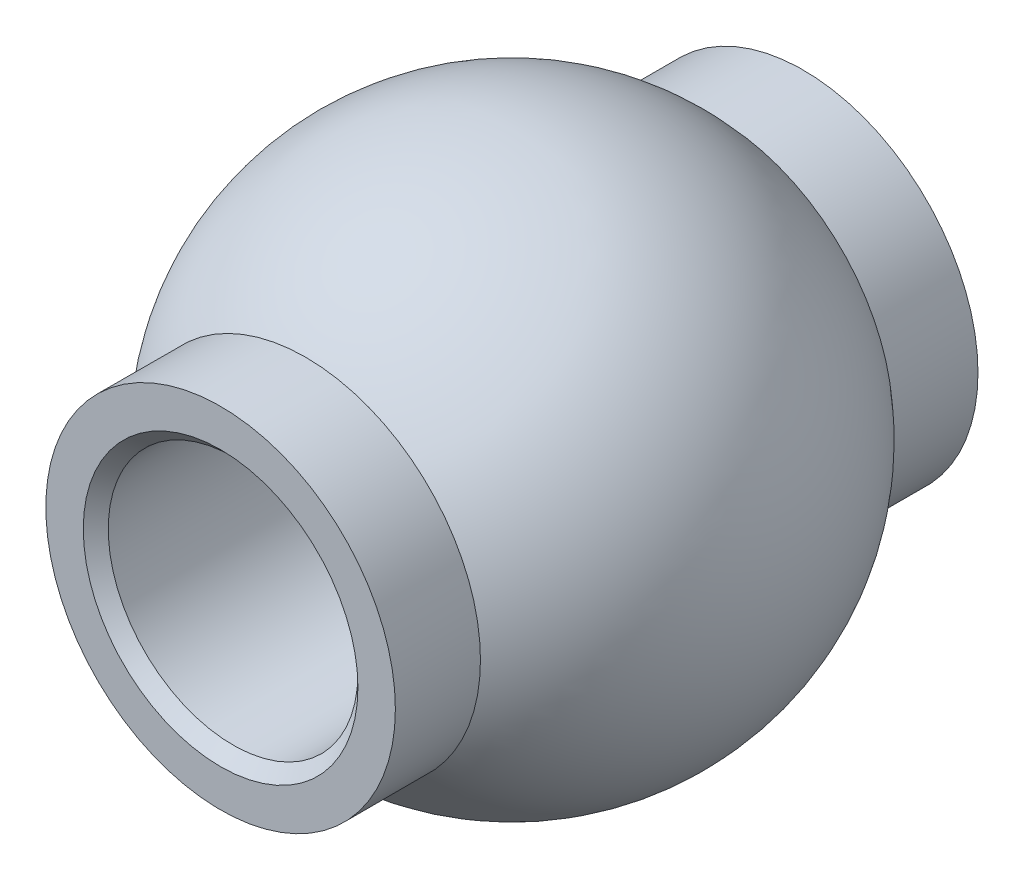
ISO-10303-21;
HEADER;
FILE_DESCRIPTION(('STEP AP214'),'2;1');
FILE_NAME('part.step','',(''),(''),'','','');
FILE_SCHEMA(('AUTOMOTIVE_DESIGN { 1 0 10303 214 1 1 1 1 }'));
ENDSEC;
DATA;
#1=APPLICATION_CONTEXT('core data for automotive mechanical design processes');
#2=APPLICATION_PROTOCOL_DEFINITION('international standard','automotive_design',2000,#1);
#3=PRODUCT_CONTEXT('',#1,'mechanical');
#4=PRODUCT('Part','Part','',(#3));
#5=PRODUCT_RELATED_PRODUCT_CATEGORY('part','',(#4));
#6=PRODUCT_DEFINITION_FORMATION('','',#4);
#7=PRODUCT_DEFINITION_CONTEXT('part definition',#1,'design');
#8=PRODUCT_DEFINITION('design','',#6,#7);
#9=PRODUCT_DEFINITION_SHAPE('','',#8);
#10=(LENGTH_UNIT() NAMED_UNIT(*) SI_UNIT(.MILLI.,.METRE.));
#11=(NAMED_UNIT(*) PLANE_ANGLE_UNIT() SI_UNIT($,.RADIAN.));
#12=(NAMED_UNIT(*) SI_UNIT($,.STERADIAN.) SOLID_ANGLE_UNIT());
#13=UNCERTAINTY_MEASURE_WITH_UNIT(LENGTH_MEASURE(1.E-05),#10,'distance_accuracy_value','');
#14=(GEOMETRIC_REPRESENTATION_CONTEXT(3) GLOBAL_UNCERTAINTY_ASSIGNED_CONTEXT((#13)) GLOBAL_UNIT_ASSIGNED_CONTEXT((#10,
#11,#12)) REPRESENTATION_CONTEXT('',''));
#15=CARTESIAN_POINT('',(0.,0.,0.));
#16=DIRECTION('',(0.,0.,1.));
#17=DIRECTION('',(1.,0.,0.));
#18=AXIS2_PLACEMENT_3D('',#15,#16,#17);
#19=CARTESIAN_POINT('',(0.,26.9875,-11.1125));
#20=DIRECTION('',(0.,0.,1.));
#21=DIRECTION('',(1.,0.,0.));
#22=AXIS2_PLACEMENT_3D('',#19,#20,#21);
#23=CYLINDRICAL_SURFACE('',#22,6.6675);
#24=CARTESIAN_POINT('',(0.,26.9875,7.86702215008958));
#25=DIRECTION('',(0.,0.,-1.));
#26=DIRECTION('',(-1.,0.,0.));
#27=AXIS2_PLACEMENT_3D('',#24,#25,#26);
#28=CIRCLE('',#27,6.6675);
#29=CARTESIAN_POINT('',(-6.66749999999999,26.9875,7.86702215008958));
#30=VERTEX_POINT('',#29);
#31=EDGE_CURVE('E75',#30,#30,#28,.F.);
#32=ORIENTED_EDGE('',*,*,#31,.T.);
#33=EDGE_LOOP('',(#32));
#34=FACE_BOUND('',#33,.T.);
#35=CARTESIAN_POINT('',(0.,26.9875,11.1125));
#36=DIRECTION('',(0.,0.,1.));
#37=DIRECTION('',(1.,0.,0.));
#38=AXIS2_PLACEMENT_3D('',#35,#36,#37);
#39=CIRCLE('',#38,6.6675);
#40=CARTESIAN_POINT('',(6.66750000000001,26.9875,11.1125));
#41=VERTEX_POINT('',#40);
#42=EDGE_CURVE('E87',#41,#41,#39,.T.);
#43=ORIENTED_EDGE('',*,*,#42,.F.);
#44=EDGE_LOOP('',(#43));
#45=FACE_BOUND('',#44,.T.);
#46=ADVANCED_FACE('F51',(#34,#45),#23,.T.);
#47=CARTESIAN_POINT('',(0.,26.9875,11.1125));
#48=DIRECTION('',(0.,0.,1.));
#49=DIRECTION('',(1.,0.,0.));
#50=AXIS2_PLACEMENT_3D('',#47,#48,#49);
#51=PLANE('',#50);
#52=CARTESIAN_POINT('',(0.,26.9875,11.1125));
#53=DIRECTION('',(0.,0.,1.));
#54=DIRECTION('',(1.,0.,0.));
#55=AXIS2_PLACEMENT_3D('',#52,#53,#54);
#56=CIRCLE('',#55,5.23875);
#57=CARTESIAN_POINT('',(5.23875000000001,26.9875,11.1125));
#58=VERTEX_POINT('',#57);
#59=EDGE_CURVE('E11',#58,#58,#56,.F.);
#60=ORIENTED_EDGE('',*,*,#59,.T.);
#61=EDGE_LOOP('',(#60));
#62=FACE_BOUND('',#61,.T.);
#63=ORIENTED_EDGE('',*,*,#42,.T.);
#64=EDGE_LOOP('',(#63));
#65=FACE_BOUND('',#64,.T.);
#66=ADVANCED_FACE('F93',(#62,#65),#51,.T.);
#67=CARTESIAN_POINT('',(0.,26.9875,0.));
#68=DIRECTION('',(0.,-1.,0.));
#69=DIRECTION('',(1.,0.,0.));
#70=AXIS2_PLACEMENT_3D('',#67,#68,#69);
#71=SPHERICAL_SURFACE('',#70,10.3124);
#72=CARTESIAN_POINT('',(0.,26.9875,0.));
#73=DIRECTION('',(0.,0.,-1.));
#74=DIRECTION('',(-1.,0.,0.));
#75=AXIS2_PLACEMENT_3D('',#72,#73,#74);
#76=SPHERICAL_SURFACE('',#75,10.3124);
#77=ORIENTED_EDGE('',*,*,#31,.F.);
#78=EDGE_LOOP('',(#77));
#79=FACE_BOUND('',#78,.T.);
#80=CARTESIAN_POINT('',(0.,26.9875,-7.86702215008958));
#81=DIRECTION('',(0.,0.,1.));
#82=DIRECTION('',(1.,0.,0.));
#83=AXIS2_PLACEMENT_3D('',#80,#81,#82);
#84=CIRCLE('',#83,6.6675);
#85=CARTESIAN_POINT('',(6.66750000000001,26.9875,-7.86702215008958));
#86=VERTEX_POINT('',#85);
#87=EDGE_CURVE('E79',#86,#86,#84,.F.);
#88=ORIENTED_EDGE('',*,*,#87,.F.);
#89=EDGE_LOOP('',(#88));
#90=FACE_BOUND('',#89,.T.);
#91=ADVANCED_FACE('F103',(#79,#90),#76,.T.);
#92=CARTESIAN_POINT('',(0.,26.9875,-11.1125));
#93=DIRECTION('',(0.,0.,1.));
#94=DIRECTION('',(1.,0.,0.));
#95=AXIS2_PLACEMENT_3D('',#92,#93,#94);
#96=PLANE('',#95);
#97=CARTESIAN_POINT('',(0.,26.9875,-11.1125));
#98=DIRECTION('',(0.,0.,1.));
#99=DIRECTION('',(1.,0.,0.));
#100=AXIS2_PLACEMENT_3D('',#97,#98,#99);
#101=CIRCLE('',#100,5.23875);
#102=CARTESIAN_POINT('',(-5.23874999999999,26.9875,-11.1125));
#103=VERTEX_POINT('',#102);
#104=EDGE_CURVE('E69',#103,#103,#101,.T.);
#105=ORIENTED_EDGE('',*,*,#104,.T.);
#106=EDGE_LOOP('',(#105));
#107=FACE_BOUND('',#106,.T.);
#108=CARTESIAN_POINT('',(0.,26.9875,-11.1125));
#109=DIRECTION('',(0.,0.,1.));
#110=DIRECTION('',(1.,0.,0.));
#111=AXIS2_PLACEMENT_3D('',#108,#109,#110);
#112=CIRCLE('',#111,6.6675);
#113=CARTESIAN_POINT('',(6.66750000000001,26.9875,-11.1125));
#114=VERTEX_POINT('',#113);
#115=EDGE_CURVE('E82',#114,#114,#112,.T.);
#116=ORIENTED_EDGE('',*,*,#115,.F.);
#117=EDGE_LOOP('',(#116));
#118=FACE_BOUND('',#117,.T.);
#119=ADVANCED_FACE('F109',(#107,#118),#96,.F.);
#120=ORIENTED_EDGE('',*,*,#87,.T.);
#121=EDGE_LOOP('',(#120));
#122=FACE_BOUND('',#121,.T.);
#123=ORIENTED_EDGE('',*,*,#115,.T.);
#124=EDGE_LOOP('',(#123));
#125=FACE_BOUND('',#124,.T.);
#126=ADVANCED_FACE('F98',(#122,#125),#23,.T.);
#127=CARTESIAN_POINT('',(0.,26.9875,-11.1125));
#128=DIRECTION('',(0.,0.,1.));
#129=DIRECTION('',(1.,0.,0.));
#130=AXIS2_PLACEMENT_3D('',#127,#128,#129);
#131=CYLINDRICAL_SURFACE('',#130,4.7625);
#132=CARTESIAN_POINT('',(0.,26.9875,-10.63625));
#133=DIRECTION('',(0.,0.,1.));
#134=DIRECTION('',(1.,0.,0.));
#135=AXIS2_PLACEMENT_3D('',#132,#133,#134);
#136=CIRCLE('',#135,4.7625);
#137=CARTESIAN_POINT('',(-4.76249999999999,26.9875,-10.63625));
#138=VERTEX_POINT('',#137);
#139=EDGE_CURVE('E59',#138,#138,#136,.F.);
#140=ORIENTED_EDGE('',*,*,#139,.T.);
#141=EDGE_LOOP('',(#140));
#142=FACE_BOUND('',#141,.T.);
#143=CARTESIAN_POINT('',(0.,26.9875,10.63625));
#144=DIRECTION('',(0.,0.,1.));
#145=DIRECTION('',(1.,0.,0.));
#146=AXIS2_PLACEMENT_3D('',#143,#144,#145);
#147=CIRCLE('',#146,4.7625);
#148=CARTESIAN_POINT('',(4.76250000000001,26.9875,10.63625));
#149=VERTEX_POINT('',#148);
#150=EDGE_CURVE('E64',#149,#149,#147,.T.);
#151=ORIENTED_EDGE('',*,*,#150,.T.);
#152=EDGE_LOOP('',(#151));
#153=FACE_BOUND('',#152,.T.);
#154=ADVANCED_FACE('F108',(#142,#153),#131,.F.);
#155=CARTESIAN_POINT('',(0.,26.9875,-11.1125));
#156=DIRECTION('',(0.,0.,-1.));
#157=DIRECTION('',(-1.,0.,0.));
#158=AXIS2_PLACEMENT_3D('',#155,#156,#157);
#159=CONICAL_SURFACE('',#158,5.23875,0.785398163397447);
#160=CARTESIAN_POINT('',(-4.76249999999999,26.9875,-10.63625));
#161=CARTESIAN_POINT('',(-4.76746093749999,26.9875,-10.6412109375));
#162=CARTESIAN_POINT('',(-4.77242187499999,26.9875,-10.646171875));
#163=CARTESIAN_POINT('',(-4.78234374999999,26.9875,-10.65609375));
#164=CARTESIAN_POINT('',(-4.78730468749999,26.9875,-10.6610546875));
#165=CARTESIAN_POINT('',(-4.79722656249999,26.9875,-10.6709765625));
#166=CARTESIAN_POINT('',(-4.80218749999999,26.9875,-10.6759375));
#167=CARTESIAN_POINT('',(-4.81210937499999,26.9875,-10.685859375));
#168=CARTESIAN_POINT('',(-4.81707031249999,26.9875,-10.6908203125));
#169=CARTESIAN_POINT('',(-4.82699218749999,26.9875,-10.7007421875));
#170=CARTESIAN_POINT('',(-4.83195312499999,26.9875,-10.705703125));
#171=CARTESIAN_POINT('',(-4.84187499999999,26.9875,-10.715625));
#172=CARTESIAN_POINT('',(-4.84683593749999,26.9875,-10.7205859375));
#173=CARTESIAN_POINT('',(-4.85675781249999,26.9875,-10.7305078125));
#174=CARTESIAN_POINT('',(-4.86171874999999,26.9875,-10.73546875));
#175=CARTESIAN_POINT('',(-4.87164062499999,26.9875,-10.745390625));
#176=CARTESIAN_POINT('',(-4.87660156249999,26.9875,-10.7503515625));
#177=CARTESIAN_POINT('',(-4.88652343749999,26.9875,-10.7602734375));
#178=CARTESIAN_POINT('',(-4.89148437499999,26.9875,-10.765234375));
#179=CARTESIAN_POINT('',(-4.90140624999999,26.9875,-10.77515625));
#180=CARTESIAN_POINT('',(-4.90636718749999,26.9875,-10.7801171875));
#181=CARTESIAN_POINT('',(-4.91628906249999,26.9875,-10.7900390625));
#182=CARTESIAN_POINT('',(-4.92124999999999,26.9875,-10.795));
#183=CARTESIAN_POINT('',(-4.93117187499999,26.9875,-10.804921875));
#184=CARTESIAN_POINT('',(-4.93613281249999,26.9875,-10.8098828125));
#185=CARTESIAN_POINT('',(-4.94605468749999,26.9875,-10.8198046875));
#186=CARTESIAN_POINT('',(-4.95101562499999,26.9875,-10.824765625));
#187=CARTESIAN_POINT('',(-4.96093749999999,26.9875,-10.8346875));
#188=CARTESIAN_POINT('',(-4.96589843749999,26.9875,-10.8396484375));
#189=CARTESIAN_POINT('',(-4.97582031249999,26.9875,-10.8495703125));
#190=CARTESIAN_POINT('',(-4.98078124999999,26.9875,-10.85453125));
#191=CARTESIAN_POINT('',(-4.99070312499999,26.9875,-10.864453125));
#192=CARTESIAN_POINT('',(-4.99566406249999,26.9875,-10.8694140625));
#193=CARTESIAN_POINT('',(-5.00558593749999,26.9875,-10.8793359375));
#194=CARTESIAN_POINT('',(-5.01054687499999,26.9875,-10.884296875));
#195=CARTESIAN_POINT('',(-5.02046874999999,26.9875,-10.89421875));
#196=CARTESIAN_POINT('',(-5.02542968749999,26.9875,-10.8991796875));
#197=CARTESIAN_POINT('',(-5.03535156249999,26.9875,-10.9091015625));
#198=CARTESIAN_POINT('',(-5.04031249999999,26.9875,-10.9140625));
#199=CARTESIAN_POINT('',(-5.05023437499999,26.9875,-10.923984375));
#200=CARTESIAN_POINT('',(-5.05519531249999,26.9875,-10.9289453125));
#201=CARTESIAN_POINT('',(-5.06511718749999,26.9875,-10.9388671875));
#202=CARTESIAN_POINT('',(-5.07007812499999,26.9875,-10.943828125));
#203=CARTESIAN_POINT('',(-5.07999999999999,26.9875,-10.95375));
#204=CARTESIAN_POINT('',(-5.08496093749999,26.9875,-10.9587109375));
#205=CARTESIAN_POINT('',(-5.09488281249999,26.9875,-10.9686328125));
#206=CARTESIAN_POINT('',(-5.09984374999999,26.9875,-10.97359375));
#207=CARTESIAN_POINT('',(-5.10976562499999,26.9875,-10.983515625));
#208=CARTESIAN_POINT('',(-5.11472656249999,26.9875,-10.9884765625));
#209=CARTESIAN_POINT('',(-5.12464843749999,26.9875,-10.9983984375));
#210=CARTESIAN_POINT('',(-5.12960937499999,26.9875,-11.003359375));
#211=CARTESIAN_POINT('',(-5.13953124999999,26.9875,-11.01328125));
#212=CARTESIAN_POINT('',(-5.14449218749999,26.9875,-11.0182421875));
#213=CARTESIAN_POINT('',(-5.15441406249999,26.9875,-11.0281640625));
#214=CARTESIAN_POINT('',(-5.15937499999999,26.9875,-11.033125));
#215=CARTESIAN_POINT('',(-5.16929687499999,26.9875,-11.043046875));
#216=CARTESIAN_POINT('',(-5.17425781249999,26.9875,-11.0480078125));
#217=CARTESIAN_POINT('',(-5.18417968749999,26.9875,-11.0579296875));
#218=CARTESIAN_POINT('',(-5.18914062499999,26.9875,-11.062890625));
#219=CARTESIAN_POINT('',(-5.19906249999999,26.9875,-11.0728125));
#220=CARTESIAN_POINT('',(-5.20402343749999,26.9875,-11.0777734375));
#221=CARTESIAN_POINT('',(-5.21394531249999,26.9875,-11.0876953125));
#222=CARTESIAN_POINT('',(-5.21890624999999,26.9875,-11.09265625));
#223=CARTESIAN_POINT('',(-5.22882812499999,26.9875,-11.102578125));
#224=CARTESIAN_POINT('',(-5.23378906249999,26.9875,-11.1075390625));
#225=CARTESIAN_POINT('',(-5.23874999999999,26.9875,-11.1125));
#226=B_SPLINE_CURVE_WITH_KNOTS('',3,(#160,#161,#162,#163,#164,#165,#166,#167,#168,#169,#170,
#171,#172,#173,#174,#175,#176,#177,#178,#179,#180,#181,#182,#183,#184,#185,#186,#187,#188,#189,
#190,#191,#192,#193,#194,#195,#196,#197,#198,#199,#200,#201,#202,#203,#204,#205,#206,#207,#208,
#209,#210,#211,#212,#213,#214,#215,#216,#217,#218,#219,#220,#221,#222,#223,#224,#225),
.UNSPECIFIED.,.F.,.F.,(4,2,2,2,2,2,2,2,2,2,2,2,2,2,2,2,2,2,2,2,2,2,2,2,2,2,2,2,2,2,2,2,4),(0.,
0.0210474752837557,0.0420949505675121,0.0631424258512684,0.0841899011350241,0.10523737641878,
0.126284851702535,0.147332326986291,0.168379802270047,0.189427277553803,0.210474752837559,
0.231522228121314,0.25256970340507,0.273617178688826,0.294664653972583,0.315712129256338,
0.336759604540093,0.35780707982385,0.378854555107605,0.399902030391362,0.420949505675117,
0.441996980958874,0.463044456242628,0.484091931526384,0.50513940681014,0.526186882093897,
0.547234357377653,0.568281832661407,0.589329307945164,0.610376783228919,0.631424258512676,
0.652471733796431,0.673519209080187),.UNSPECIFIED.);
#227=EDGE_CURVE('BSEAM114',#138,#103,#226,.T.);
#228=ORIENTED_EDGE('',*,*,#139,.F.);
#229=ORIENTED_EDGE('',*,*,#104,.F.);
#230=ORIENTED_EDGE('',*,*,#227,.T.);
#231=ORIENTED_EDGE('',*,*,#227,.F.);
#232=EDGE_LOOP('',(#228,#230,#229,#231));
#233=FACE_BOUND('',#232,.T.);
#234=ADVANCED_FACE('F114',(#233),#159,.F.);
#235=CARTESIAN_POINT('',(0.,26.9875,10.63625));
#236=DIRECTION('',(0.,0.,1.));
#237=DIRECTION('',(1.,0.,0.));
#238=AXIS2_PLACEMENT_3D('',#235,#236,#237);
#239=CONICAL_SURFACE('',#238,4.7625,0.785398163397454);
#240=ORIENTED_EDGE('',*,*,#59,.F.);
#241=EDGE_LOOP('',(#240));
#242=FACE_BOUND('',#241,.T.);
#243=ORIENTED_EDGE('',*,*,#150,.F.);
#244=EDGE_LOOP('',(#243));
#245=FACE_BOUND('',#244,.T.);
#246=ADVANCED_FACE('F53',(#242,#245),#239,.F.);
#247=CLOSED_SHELL('',(#46,#66,#91,#119,#126,#154,#234,#246));
#248=MANIFOLD_SOLID_BREP('B2',#247);
#249=ADVANCED_BREP_SHAPE_REPRESENTATION('',(#18,#248),#14);
#250=SHAPE_DEFINITION_REPRESENTATION(#9,#249);
ENDSEC;
END-ISO-10303-21;
